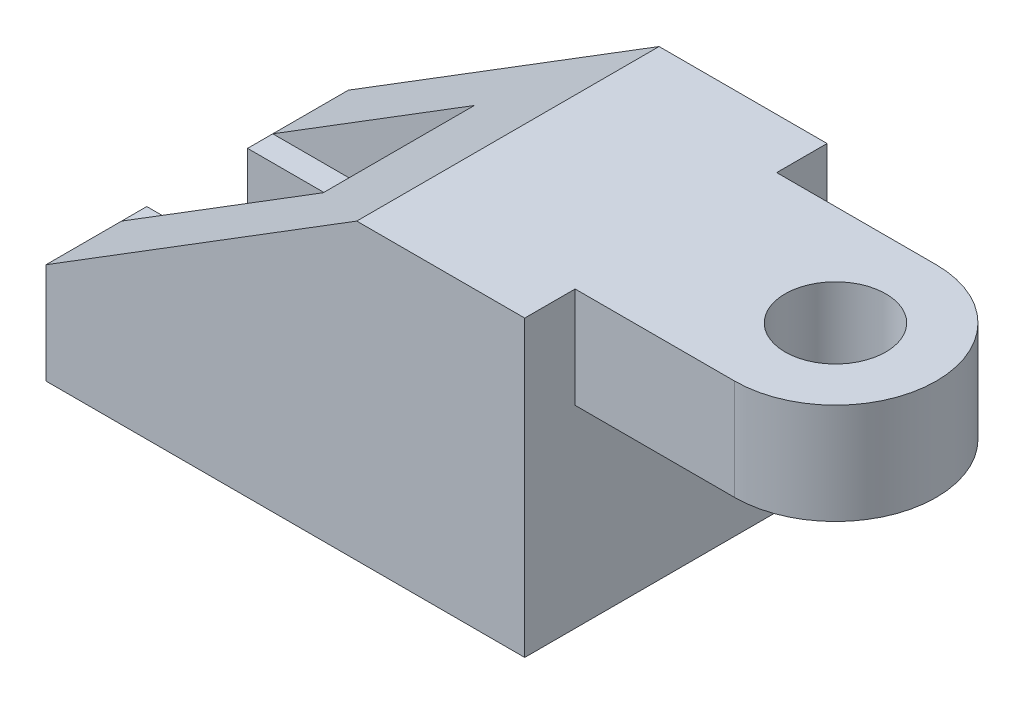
ISO-10303-21;
HEADER;
FILE_DESCRIPTION(('STEP AP214'),'2;1');
FILE_NAME('part.step','',(''),(''),'','','');
FILE_SCHEMA(('AUTOMOTIVE_DESIGN { 1 0 10303 214 1 1 1 1 }'));
ENDSEC;
DATA;
#1=APPLICATION_CONTEXT('core data for automotive mechanical design processes');
#2=APPLICATION_PROTOCOL_DEFINITION('international standard','automotive_design',2000,#1);
#3=PRODUCT_CONTEXT('',#1,'mechanical');
#4=PRODUCT('Part','Part','',(#3));
#5=PRODUCT_RELATED_PRODUCT_CATEGORY('part','',(#4));
#6=PRODUCT_DEFINITION_FORMATION('','',#4);
#7=PRODUCT_DEFINITION_CONTEXT('part definition',#1,'design');
#8=PRODUCT_DEFINITION('design','',#6,#7);
#9=PRODUCT_DEFINITION_SHAPE('','',#8);
#10=(LENGTH_UNIT() NAMED_UNIT(*) SI_UNIT(.MILLI.,.METRE.));
#11=(NAMED_UNIT(*) PLANE_ANGLE_UNIT() SI_UNIT($,.RADIAN.));
#12=(NAMED_UNIT(*) SI_UNIT($,.STERADIAN.) SOLID_ANGLE_UNIT());
#13=UNCERTAINTY_MEASURE_WITH_UNIT(LENGTH_MEASURE(1.E-05),#10,'distance_accuracy_value','');
#14=(GEOMETRIC_REPRESENTATION_CONTEXT(3) GLOBAL_UNCERTAINTY_ASSIGNED_CONTEXT((#13)) GLOBAL_UNIT_ASSIGNED_CONTEXT((#10,
#11,#12)) REPRESENTATION_CONTEXT('',''));
#15=CARTESIAN_POINT('',(0.,0.,0.));
#16=DIRECTION('',(0.,0.,1.));
#17=DIRECTION('',(1.,0.,0.));
#18=AXIS2_PLACEMENT_3D('',#15,#16,#17);
#19=CARTESIAN_POINT('',(0.,35.,18.));
#20=DIRECTION('',(-1.,0.,0.));
#21=DIRECTION('',(0.,-1.,0.));
#22=AXIS2_PLACEMENT_3D('',#19,#20,#21);
#23=PLANE('',#22);
#24=DIRECTION('',(0.,1.,0.));
#25=VECTOR('',#24,1.);
#26=CARTESIAN_POINT('',(0.,23.,-12.));
#27=LINE('',#26,#25);
#28=CARTESIAN_POINT('',(0.,23.,-12.));
#29=VERTEX_POINT('',#28);
#30=CARTESIAN_POINT('',(0.,35.,-12.));
#31=VERTEX_POINT('',#30);
#32=EDGE_CURVE('E165',#29,#31,#27,.T.);
#33=ORIENTED_EDGE('',*,*,#32,.F.);
#34=DIRECTION('',(0.,0.,1.));
#35=VECTOR('',#34,1.);
#36=CARTESIAN_POINT('',(0.,23.,12.));
#37=LINE('',#36,#35);
#38=CARTESIAN_POINT('',(0.,23.,12.));
#39=VERTEX_POINT('',#38);
#40=EDGE_CURVE('E158',#29,#39,#37,.T.);
#41=ORIENTED_EDGE('',*,*,#40,.T.);
#42=DIRECTION('',(0.,1.,0.));
#43=VECTOR('',#42,1.);
#44=CARTESIAN_POINT('',(0.,23.,12.));
#45=LINE('',#44,#43);
#46=CARTESIAN_POINT('',(0.,35.,12.));
#47=VERTEX_POINT('',#46);
#48=EDGE_CURVE('E144',#39,#47,#45,.T.);
#49=ORIENTED_EDGE('',*,*,#48,.T.);
#50=DIRECTION('',(0.,0.,-1.));
#51=VECTOR('',#50,1.);
#52=CARTESIAN_POINT('',(0.,35.,18.));
#53=LINE('',#52,#51);
#54=CARTESIAN_POINT('',(0.,35.,18.));
#55=VERTEX_POINT('',#54);
#56=EDGE_CURVE('E11',#55,#47,#53,.T.);
#57=ORIENTED_EDGE('',*,*,#56,.F.);
#58=DIRECTION('',(0.,1.,0.));
#59=VECTOR('',#58,1.);
#60=CARTESIAN_POINT('',(0.,35.,18.));
#61=LINE('',#60,#59);
#62=CARTESIAN_POINT('',(0.,0.,18.));
#63=VERTEX_POINT('',#62);
#64=EDGE_CURVE('E247',#63,#55,#61,.T.);
#65=ORIENTED_EDGE('',*,*,#64,.F.);
#66=DIRECTION('',(0.,0.,-1.));
#67=VECTOR('',#66,1.);
#68=CARTESIAN_POINT('',(0.,0.,18.));
#69=LINE('',#68,#67);
#70=CARTESIAN_POINT('',(0.,0.,-18.));
#71=VERTEX_POINT('',#70);
#72=EDGE_CURVE('E259',#63,#71,#69,.T.);
#73=ORIENTED_EDGE('',*,*,#72,.T.);
#74=DIRECTION('',(0.,1.,0.));
#75=VECTOR('',#74,1.);
#76=CARTESIAN_POINT('',(0.,35.,-18.));
#77=LINE('',#76,#75);
#78=CARTESIAN_POINT('',(0.,35.,-18.));
#79=VERTEX_POINT('',#78);
#80=EDGE_CURVE('E241',#71,#79,#77,.T.);
#81=ORIENTED_EDGE('',*,*,#80,.T.);
#82=EDGE_CURVE('E39',#31,#79,#53,.T.);
#83=ORIENTED_EDGE('',*,*,#82,.F.);
#84=EDGE_LOOP('',(#33,#41,#49,#57,#65,#73,#81,#83));
#85=FACE_BOUND('',#84,.T.);
#86=ADVANCED_FACE('F31',(#85),#23,.F.);
#87=CARTESIAN_POINT('',(-57.,0.,18.));
#88=DIRECTION('',(1.,0.,0.));
#89=DIRECTION('',(0.,0.,-1.));
#90=AXIS2_PLACEMENT_3D('',#87,#88,#89);
#91=PLANE('',#90);
#92=DIRECTION('',(0.,0.,-1.));
#93=VECTOR('',#92,1.);
#94=CARTESIAN_POINT('',(-57.,0.,18.));
#95=LINE('',#94,#93);
#96=CARTESIAN_POINT('',(-57.,0.,-5.99999999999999));
#97=VERTEX_POINT('',#96);
#98=CARTESIAN_POINT('',(-57.,0.,-18.));
#99=VERTEX_POINT('',#98);
#100=EDGE_CURVE('E273',#97,#99,#95,.T.);
#101=ORIENTED_EDGE('',*,*,#100,.F.);
#102=DIRECTION('',(0.,1.,0.));
#103=VECTOR('',#102,1.);
#104=CARTESIAN_POINT('',(-57.,-6.00000000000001,-5.99999999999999));
#105=LINE('',#104,#103);
#106=CARTESIAN_POINT('',(-57.,12.,-5.99999999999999));
#107=VERTEX_POINT('',#106);
#108=EDGE_CURVE('E203',#97,#107,#105,.T.);
#109=ORIENTED_EDGE('',*,*,#108,.T.);
#110=DIRECTION('',(0.,0.,1.));
#111=VECTOR('',#110,1.);
#112=CARTESIAN_POINT('',(-57.,12.,-9.));
#113=LINE('',#112,#111);
#114=CARTESIAN_POINT('',(-57.,12.,-9.));
#115=VERTEX_POINT('',#114);
#116=EDGE_CURVE('E244',#115,#107,#113,.T.);
#117=ORIENTED_EDGE('',*,*,#116,.F.);
#118=DIRECTION('',(0.,0.,-1.));
#119=VECTOR('',#118,1.);
#120=CARTESIAN_POINT('',(-57.,12.,18.));
#121=LINE('',#120,#119);
#122=CARTESIAN_POINT('',(-57.,12.,-18.));
#123=VERTEX_POINT('',#122);
#124=EDGE_CURVE('E277',#115,#123,#121,.T.);
#125=ORIENTED_EDGE('',*,*,#124,.T.);
#126=DIRECTION('',(0.,-1.,0.));
#127=VECTOR('',#126,1.);
#128=CARTESIAN_POINT('',(-57.,0.,-18.));
#129=LINE('',#128,#127);
#130=EDGE_CURVE('E267',#123,#99,#129,.T.);
#131=ORIENTED_EDGE('',*,*,#130,.T.);
#132=EDGE_LOOP('',(#101,#109,#117,#125,#131));
#133=FACE_BOUND('',#132,.T.);
#134=ADVANCED_FACE('F300',(#133),#91,.F.);
#135=CARTESIAN_POINT('',(-20.,35.,18.));
#136=DIRECTION('',(0.,-1.,0.));
#137=DIRECTION('',(0.,0.,-1.));
#138=AXIS2_PLACEMENT_3D('',#135,#136,#137);
#139=PLANE('',#138);
#140=DIRECTION('',(-1.,0.,0.));
#141=VECTOR('',#140,1.);
#142=CARTESIAN_POINT('',(-20.,35.,-18.));
#143=LINE('',#142,#141);
#144=CARTESIAN_POINT('',(-20.,35.,-18.));
#145=VERTEX_POINT('',#144);
#146=EDGE_CURVE('E262',#79,#145,#143,.T.);
#147=ORIENTED_EDGE('',*,*,#146,.T.);
#148=DIRECTION('',(0.,0.,-1.));
#149=VECTOR('',#148,1.);
#150=CARTESIAN_POINT('',(-20.,35.,18.));
#151=LINE('',#150,#149);
#152=CARTESIAN_POINT('',(-20.,35.,18.));
#153=VERTEX_POINT('',#152);
#154=EDGE_CURVE('E281',#153,#145,#151,.T.);
#155=ORIENTED_EDGE('',*,*,#154,.F.);
#156=DIRECTION('',(-1.,0.,0.));
#157=VECTOR('',#156,1.);
#158=CARTESIAN_POINT('',(-20.,35.,18.));
#159=LINE('',#158,#157);
#160=EDGE_CURVE('E250',#55,#153,#159,.T.);
#161=ORIENTED_EDGE('',*,*,#160,.F.);
#162=ORIENTED_EDGE('',*,*,#56,.T.);
#163=DIRECTION('',(1.,0.,0.));
#164=VECTOR('',#163,1.);
#165=CARTESIAN_POINT('',(19.,35.,12.));
#166=LINE('',#165,#164);
#167=CARTESIAN_POINT('',(19.,35.,12.));
#168=VERTEX_POINT('',#167);
#169=EDGE_CURVE('E47',#47,#168,#166,.T.);
#170=ORIENTED_EDGE('',*,*,#169,.T.);
#171=CARTESIAN_POINT('',(19.,35.,0.));
#172=DIRECTION('',(0.,1.,0.));
#173=DIRECTION('',(0.,0.,-1.));
#174=AXIS2_PLACEMENT_3D('',#171,#172,#173);
#175=CIRCLE('',#174,12.);
#176=CARTESIAN_POINT('',(19.,35.,-12.));
#177=VERTEX_POINT('',#176);
#178=EDGE_CURVE('E169',#168,#177,#175,.T.);
#179=ORIENTED_EDGE('',*,*,#178,.T.);
#180=DIRECTION('',(-1.,0.,0.));
#181=VECTOR('',#180,1.);
#182=CARTESIAN_POINT('',(0.,35.,-12.));
#183=LINE('',#182,#181);
#184=EDGE_CURVE('E166',#177,#31,#183,.T.);
#185=ORIENTED_EDGE('',*,*,#184,.T.);
#186=ORIENTED_EDGE('',*,*,#82,.T.);
#187=EDGE_LOOP('',(#147,#155,#161,#162,#170,#179,#185,#186));
#188=FACE_BOUND('',#187,.T.);
#189=CARTESIAN_POINT('',(19.,35.,0.));
#190=DIRECTION('',(0.,1.,0.));
#191=DIRECTION('',(0.,0.,1.));
#192=AXIS2_PLACEMENT_3D('',#189,#190,#191);
#193=CIRCLE('',#192,6.);
#194=CARTESIAN_POINT('',(19.,35.,6.));
#195=VERTEX_POINT('',#194);
#196=EDGE_CURVE('E171',#195,#195,#193,.T.);
#197=ORIENTED_EDGE('',*,*,#196,.F.);
#198=EDGE_LOOP('',(#197));
#199=FACE_BOUND('',#198,.T.);
#200=ADVANCED_FACE('F297',(#188,#199),#139,.F.);
#201=CARTESIAN_POINT('',(-57.,12.,18.));
#202=DIRECTION('',(0.527934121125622,-0.849285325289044,0.));
#203=DIRECTION('',(0.849285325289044,0.527934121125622,0.));
#204=AXIS2_PLACEMENT_3D('',#201,#202,#203);
#205=PLANE('',#204);
#206=ORIENTED_EDGE('',*,*,#124,.F.);
#207=DIRECTION('',(-0.849285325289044,-0.527934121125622,0.));
#208=VECTOR('',#207,1.);
#209=CARTESIAN_POINT('',(-33.,26.9189189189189,-9.));
#210=LINE('',#209,#208);
#211=CARTESIAN_POINT('',(-33.,26.9189189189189,-9.));
#212=VERTEX_POINT('',#211);
#213=EDGE_CURVE('E221',#212,#115,#210,.T.);
#214=ORIENTED_EDGE('',*,*,#213,.F.);
#215=DIRECTION('',(0.,0.,1.));
#216=VECTOR('',#215,1.);
#217=CARTESIAN_POINT('',(-33.,26.9189189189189,-9.));
#218=LINE('',#217,#216);
#219=CARTESIAN_POINT('',(-33.,26.9189189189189,9.));
#220=VERTEX_POINT('',#219);
#221=EDGE_CURVE('E238',#212,#220,#218,.T.);
#222=ORIENTED_EDGE('',*,*,#221,.T.);
#223=DIRECTION('',(-0.849285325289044,-0.527934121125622,0.));
#224=VECTOR('',#223,1.);
#225=CARTESIAN_POINT('',(-33.,26.9189189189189,9.));
#226=LINE('',#225,#224);
#227=CARTESIAN_POINT('',(-57.,12.,9.));
#228=VERTEX_POINT('',#227);
#229=EDGE_CURVE('E220',#220,#228,#226,.T.);
#230=ORIENTED_EDGE('',*,*,#229,.T.);
#231=CARTESIAN_POINT('',(-57.,12.,18.));
#232=VERTEX_POINT('',#231);
#233=EDGE_CURVE('E278',#232,#228,#121,.T.);
#234=ORIENTED_EDGE('',*,*,#233,.F.);
#235=DIRECTION('',(-0.849285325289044,-0.527934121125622,0.));
#236=VECTOR('',#235,1.);
#237=CARTESIAN_POINT('',(-57.,12.,18.));
#238=LINE('',#237,#236);
#239=EDGE_CURVE('E253',#153,#232,#238,.T.);
#240=ORIENTED_EDGE('',*,*,#239,.F.);
#241=ORIENTED_EDGE('',*,*,#154,.T.);
#242=DIRECTION('',(-0.849285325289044,-0.527934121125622,0.));
#243=VECTOR('',#242,1.);
#244=CARTESIAN_POINT('',(-57.,12.,-18.));
#245=LINE('',#244,#243);
#246=EDGE_CURVE('E264',#145,#123,#245,.T.);
#247=ORIENTED_EDGE('',*,*,#246,.T.);
#248=EDGE_LOOP('',(#206,#214,#222,#230,#234,#240,#241,#247));
#249=FACE_BOUND('',#248,.T.);
#250=ADVANCED_FACE('F299',(#249),#205,.F.);
#251=CARTESIAN_POINT('',(-57.,12.,6.00000000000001));
#252=VERTEX_POINT('',#251);
#253=EDGE_CURVE('E230',#252,#228,#113,.T.);
#254=ORIENTED_EDGE('',*,*,#253,.F.);
#255=DIRECTION('',(0.,1.,0.));
#256=VECTOR('',#255,1.);
#257=CARTESIAN_POINT('',(-57.,-6.00000000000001,6.00000000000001));
#258=LINE('',#257,#256);
#259=CARTESIAN_POINT('',(-57.,0.,6.00000000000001));
#260=VERTEX_POINT('',#259);
#261=EDGE_CURVE('E55',#260,#252,#258,.T.);
#262=ORIENTED_EDGE('',*,*,#261,.F.);
#263=CARTESIAN_POINT('',(-57.,0.,18.));
#264=VERTEX_POINT('',#263);
#265=EDGE_CURVE('E274',#264,#260,#95,.T.);
#266=ORIENTED_EDGE('',*,*,#265,.F.);
#267=DIRECTION('',(0.,-1.,0.));
#268=VECTOR('',#267,1.);
#269=CARTESIAN_POINT('',(-57.,0.,18.));
#270=LINE('',#269,#268);
#271=EDGE_CURVE('E255',#232,#264,#270,.T.);
#272=ORIENTED_EDGE('',*,*,#271,.F.);
#273=ORIENTED_EDGE('',*,*,#233,.T.);
#274=EDGE_LOOP('',(#254,#262,#266,#272,#273));
#275=FACE_BOUND('',#274,.T.);
#276=ADVANCED_FACE('F305',(#275),#91,.F.);
#277=CARTESIAN_POINT('',(0.,0.,18.));
#278=DIRECTION('',(0.,1.,0.));
#279=DIRECTION('',(-1.,0.,0.));
#280=AXIS2_PLACEMENT_3D('',#277,#278,#279);
#281=PLANE('',#280);
#282=CARTESIAN_POINT('',(-44.,0.,0.));
#283=DIRECTION('',(0.,1.,0.));
#284=DIRECTION('',(-1.,0.,0.));
#285=AXIS2_PLACEMENT_3D('',#282,#283,#284);
#286=CIRCLE('',#285,6.);
#287=CARTESIAN_POINT('',(-44.,0.,6.));
#288=VERTEX_POINT('',#287);
#289=CARTESIAN_POINT('',(-44.,0.,-5.99999999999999));
#290=VERTEX_POINT('',#289);
#291=EDGE_CURVE('E214',#288,#290,#286,.T.);
#292=ORIENTED_EDGE('',*,*,#291,.T.);
#293=DIRECTION('',(-1.,0.,0.));
#294=VECTOR('',#293,1.);
#295=CARTESIAN_POINT('',(0.,0.,-5.99999999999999));
#296=LINE('',#295,#294);
#297=EDGE_CURVE('E217',#290,#97,#296,.T.);
#298=ORIENTED_EDGE('',*,*,#297,.T.);
#299=ORIENTED_EDGE('',*,*,#100,.T.);
#300=DIRECTION('',(1.,0.,0.));
#301=VECTOR('',#300,1.);
#302=CARTESIAN_POINT('',(0.,0.,-18.));
#303=LINE('',#302,#301);
#304=EDGE_CURVE('E251',#99,#71,#303,.T.);
#305=ORIENTED_EDGE('',*,*,#304,.T.);
#306=ORIENTED_EDGE('',*,*,#72,.F.);
#307=DIRECTION('',(1.,0.,0.));
#308=VECTOR('',#307,1.);
#309=CARTESIAN_POINT('',(0.,0.,18.));
#310=LINE('',#309,#308);
#311=EDGE_CURVE('E257',#264,#63,#310,.T.);
#312=ORIENTED_EDGE('',*,*,#311,.F.);
#313=ORIENTED_EDGE('',*,*,#265,.T.);
#314=DIRECTION('',(1.,0.,0.));
#315=VECTOR('',#314,1.);
#316=CARTESIAN_POINT('',(0.,0.,5.99999999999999));
#317=LINE('',#316,#315);
#318=EDGE_CURVE('E206',#260,#288,#317,.T.);
#319=ORIENTED_EDGE('',*,*,#318,.T.);
#320=EDGE_LOOP('',(#292,#298,#299,#305,#306,#312,#313,#319));
#321=FACE_BOUND('',#320,.T.);
#322=ADVANCED_FACE('F334',(#321),#281,.F.);
#323=CARTESIAN_POINT('',(0.,35.,18.));
#324=DIRECTION('',(0.,0.,1.));
#325=DIRECTION('',(1.,0.,0.));
#326=AXIS2_PLACEMENT_3D('',#323,#324,#325);
#327=PLANE('',#326);
#328=ORIENTED_EDGE('',*,*,#64,.T.);
#329=ORIENTED_EDGE('',*,*,#160,.T.);
#330=ORIENTED_EDGE('',*,*,#239,.T.);
#331=ORIENTED_EDGE('',*,*,#271,.T.);
#332=ORIENTED_EDGE('',*,*,#311,.T.);
#333=EDGE_LOOP('',(#328,#329,#330,#331,#332));
#334=FACE_BOUND('',#333,.T.);
#335=ADVANCED_FACE('F344',(#334),#327,.T.);
#336=CARTESIAN_POINT('',(0.,35.,-18.));
#337=DIRECTION('',(0.,0.,1.));
#338=DIRECTION('',(1.,0.,0.));
#339=AXIS2_PLACEMENT_3D('',#336,#337,#338);
#340=PLANE('',#339);
#341=ORIENTED_EDGE('',*,*,#80,.F.);
#342=ORIENTED_EDGE('',*,*,#304,.F.);
#343=ORIENTED_EDGE('',*,*,#130,.F.);
#344=ORIENTED_EDGE('',*,*,#246,.F.);
#345=ORIENTED_EDGE('',*,*,#146,.F.);
#346=EDGE_LOOP('',(#341,#342,#343,#344,#345));
#347=FACE_BOUND('',#346,.T.);
#348=ADVANCED_FACE('F453',(#347),#340,.F.);
#349=CARTESIAN_POINT('',(-33.,12.,-9.));
#350=DIRECTION('',(1.,0.,0.));
#351=DIRECTION('',(0.,0.,-1.));
#352=AXIS2_PLACEMENT_3D('',#349,#350,#351);
#353=PLANE('',#352);
#354=DIRECTION('',(0.,1.,0.));
#355=VECTOR('',#354,1.);
#356=CARTESIAN_POINT('',(-33.,12.,9.));
#357=LINE('',#356,#355);
#358=CARTESIAN_POINT('',(-33.,12.,9.));
#359=VERTEX_POINT('',#358);
#360=EDGE_CURVE('E224',#359,#220,#357,.T.);
#361=ORIENTED_EDGE('',*,*,#360,.T.);
#362=ORIENTED_EDGE('',*,*,#221,.F.);
#363=DIRECTION('',(0.,1.,0.));
#364=VECTOR('',#363,1.);
#365=CARTESIAN_POINT('',(-33.,12.,-9.));
#366=LINE('',#365,#364);
#367=CARTESIAN_POINT('',(-33.,12.,-9.));
#368=VERTEX_POINT('',#367);
#369=EDGE_CURVE('E227',#368,#212,#366,.T.);
#370=ORIENTED_EDGE('',*,*,#369,.F.);
#371=DIRECTION('',(0.,0.,1.));
#372=VECTOR('',#371,1.);
#373=CARTESIAN_POINT('',(-33.,12.,-9.));
#374=LINE('',#373,#372);
#375=EDGE_CURVE('E242',#368,#359,#374,.T.);
#376=ORIENTED_EDGE('',*,*,#375,.T.);
#377=EDGE_LOOP('',(#361,#362,#370,#376));
#378=FACE_BOUND('',#377,.T.);
#379=ADVANCED_FACE('F358',(#378),#353,.F.);
#380=CARTESIAN_POINT('',(-57.,12.,-9.));
#381=DIRECTION('',(0.,-1.,0.));
#382=DIRECTION('',(0.,0.,-1.));
#383=AXIS2_PLACEMENT_3D('',#380,#381,#382);
#384=PLANE('',#383);
#385=ORIENTED_EDGE('',*,*,#116,.T.);
#386=DIRECTION('',(-1.,0.,0.));
#387=VECTOR('',#386,1.);
#388=CARTESIAN_POINT('',(-57.,12.,-5.99999999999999));
#389=LINE('',#388,#387);
#390=CARTESIAN_POINT('',(-44.,12.,-5.99999999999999));
#391=VERTEX_POINT('',#390);
#392=EDGE_CURVE('E197',#391,#107,#389,.T.);
#393=ORIENTED_EDGE('',*,*,#392,.F.);
#394=CARTESIAN_POINT('',(-44.,12.,0.));
#395=DIRECTION('',(0.,1.,0.));
#396=DIRECTION('',(0.,0.,-1.));
#397=AXIS2_PLACEMENT_3D('',#394,#395,#396);
#398=CIRCLE('',#397,6.);
#399=CARTESIAN_POINT('',(-44.,12.,6.));
#400=VERTEX_POINT('',#399);
#401=EDGE_CURVE('E193',#400,#391,#398,.T.);
#402=ORIENTED_EDGE('',*,*,#401,.F.);
#403=DIRECTION('',(1.,0.,0.));
#404=VECTOR('',#403,1.);
#405=CARTESIAN_POINT('',(-44.,12.,6.));
#406=LINE('',#405,#404);
#407=EDGE_CURVE('E183',#252,#400,#406,.T.);
#408=ORIENTED_EDGE('',*,*,#407,.F.);
#409=ORIENTED_EDGE('',*,*,#253,.T.);
#410=DIRECTION('',(1.,0.,0.));
#411=VECTOR('',#410,1.);
#412=CARTESIAN_POINT('',(-57.,12.,9.));
#413=LINE('',#412,#411);
#414=EDGE_CURVE('E233',#228,#359,#413,.T.);
#415=ORIENTED_EDGE('',*,*,#414,.T.);
#416=ORIENTED_EDGE('',*,*,#375,.F.);
#417=DIRECTION('',(1.,0.,0.));
#418=VECTOR('',#417,1.);
#419=CARTESIAN_POINT('',(-57.,12.,-9.));
#420=LINE('',#419,#418);
#421=EDGE_CURVE('E223',#115,#368,#420,.T.);
#422=ORIENTED_EDGE('',*,*,#421,.F.);
#423=EDGE_LOOP('',(#385,#393,#402,#408,#409,#415,#416,#422));
#424=FACE_BOUND('',#423,.T.);
#425=ADVANCED_FACE('F352',(#424),#384,.F.);
#426=CARTESIAN_POINT('',(-33.,26.9189189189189,-9.));
#427=DIRECTION('',(0.,0.,-1.));
#428=DIRECTION('',(-1.,0.,0.));
#429=AXIS2_PLACEMENT_3D('',#426,#427,#428);
#430=PLANE('',#429);
#431=ORIENTED_EDGE('',*,*,#213,.T.);
#432=ORIENTED_EDGE('',*,*,#421,.T.);
#433=ORIENTED_EDGE('',*,*,#369,.T.);
#434=EDGE_LOOP('',(#431,#432,#433));
#435=FACE_BOUND('',#434,.T.);
#436=ADVANCED_FACE('F357',(#435),#430,.F.);
#437=CARTESIAN_POINT('',(-33.,26.9189189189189,9.));
#438=DIRECTION('',(0.,0.,-1.));
#439=DIRECTION('',(-1.,0.,0.));
#440=AXIS2_PLACEMENT_3D('',#437,#438,#439);
#441=PLANE('',#440);
#442=ORIENTED_EDGE('',*,*,#229,.F.);
#443=ORIENTED_EDGE('',*,*,#360,.F.);
#444=ORIENTED_EDGE('',*,*,#414,.F.);
#445=EDGE_LOOP('',(#442,#443,#444));
#446=FACE_BOUND('',#445,.T.);
#447=ADVANCED_FACE('F326',(#446),#441,.T.);
#448=CARTESIAN_POINT('',(-57.,-6.00000000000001,-5.99999999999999));
#449=DIRECTION('',(0.,0.,-1.));
#450=DIRECTION('',(-1.,0.,0.));
#451=AXIS2_PLACEMENT_3D('',#448,#449,#450);
#452=PLANE('',#451);
#453=DIRECTION('',(0.,1.,0.));
#454=VECTOR('',#453,1.);
#455=CARTESIAN_POINT('',(-44.,-6.00000000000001,-5.99999999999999));
#456=LINE('',#455,#454);
#457=EDGE_CURVE('E207',#290,#391,#456,.T.);
#458=ORIENTED_EDGE('',*,*,#457,.T.);
#459=ORIENTED_EDGE('',*,*,#392,.T.);
#460=ORIENTED_EDGE('',*,*,#108,.F.);
#461=ORIENTED_EDGE('',*,*,#297,.F.);
#462=EDGE_LOOP('',(#458,#459,#460,#461));
#463=FACE_BOUND('',#462,.T.);
#464=ADVANCED_FACE('F368',(#463),#452,.F.);
#465=CARTESIAN_POINT('',(-44.,-6.00000000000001,0.));
#466=DIRECTION('',(0.,1.,0.));
#467=DIRECTION('',(0.,0.,1.));
#468=AXIS2_PLACEMENT_3D('',#465,#466,#467);
#469=CYLINDRICAL_SURFACE('',#468,6.);
#470=DIRECTION('',(0.,1.,0.));
#471=VECTOR('',#470,1.);
#472=CARTESIAN_POINT('',(-44.,-6.00000000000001,6.));
#473=LINE('',#472,#471);
#474=EDGE_CURVE('E209',#288,#400,#473,.T.);
#475=ORIENTED_EDGE('',*,*,#474,.T.);
#476=ORIENTED_EDGE('',*,*,#401,.T.);
#477=ORIENTED_EDGE('',*,*,#457,.F.);
#478=ORIENTED_EDGE('',*,*,#291,.F.);
#479=EDGE_LOOP('',(#475,#476,#477,#478));
#480=FACE_BOUND('',#479,.T.);
#481=ADVANCED_FACE('F372',(#480),#469,.F.);
#482=CARTESIAN_POINT('',(-44.,-6.00000000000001,6.));
#483=DIRECTION('',(0.,0.,1.));
#484=DIRECTION('',(1.,0.,0.));
#485=AXIS2_PLACEMENT_3D('',#482,#483,#484);
#486=PLANE('',#485);
#487=ORIENTED_EDGE('',*,*,#261,.T.);
#488=ORIENTED_EDGE('',*,*,#407,.T.);
#489=ORIENTED_EDGE('',*,*,#474,.F.);
#490=ORIENTED_EDGE('',*,*,#318,.F.);
#491=EDGE_LOOP('',(#487,#488,#489,#490));
#492=FACE_BOUND('',#491,.T.);
#493=ADVANCED_FACE('F381',(#492),#486,.F.);
#494=CARTESIAN_POINT('',(0.,23.,-12.));
#495=DIRECTION('',(0.,0.,-1.));
#496=DIRECTION('',(-1.,0.,0.));
#497=AXIS2_PLACEMENT_3D('',#494,#495,#496);
#498=PLANE('',#497);
#499=ORIENTED_EDGE('',*,*,#184,.F.);
#500=DIRECTION('',(0.,1.,0.));
#501=VECTOR('',#500,1.);
#502=CARTESIAN_POINT('',(19.,23.,-12.));
#503=LINE('',#502,#501);
#504=CARTESIAN_POINT('',(19.,23.,-12.));
#505=VERTEX_POINT('',#504);
#506=EDGE_CURVE('E178',#505,#177,#503,.T.);
#507=ORIENTED_EDGE('',*,*,#506,.F.);
#508=DIRECTION('',(-1.,0.,0.));
#509=VECTOR('',#508,1.);
#510=CARTESIAN_POINT('',(0.,23.,-12.));
#511=LINE('',#510,#509);
#512=EDGE_CURVE('E152',#505,#29,#511,.T.);
#513=ORIENTED_EDGE('',*,*,#512,.T.);
#514=ORIENTED_EDGE('',*,*,#32,.T.);
#515=EDGE_LOOP('',(#499,#507,#513,#514));
#516=FACE_BOUND('',#515,.T.);
#517=ADVANCED_FACE('F389',(#516),#498,.T.);
#518=CARTESIAN_POINT('',(19.,23.,0.));
#519=DIRECTION('',(0.,1.,0.));
#520=DIRECTION('',(0.,0.,1.));
#521=AXIS2_PLACEMENT_3D('',#518,#519,#520);
#522=CYLINDRICAL_SURFACE('',#521,12.);
#523=ORIENTED_EDGE('',*,*,#178,.F.);
#524=DIRECTION('',(0.,1.,0.));
#525=VECTOR('',#524,1.);
#526=CARTESIAN_POINT('',(19.,23.,12.));
#527=LINE('',#526,#525);
#528=CARTESIAN_POINT('',(19.,23.,12.));
#529=VERTEX_POINT('',#528);
#530=EDGE_CURVE('E151',#529,#168,#527,.T.);
#531=ORIENTED_EDGE('',*,*,#530,.F.);
#532=CARTESIAN_POINT('',(19.,23.,0.));
#533=DIRECTION('',(0.,1.,0.));
#534=DIRECTION('',(0.,0.,-1.));
#535=AXIS2_PLACEMENT_3D('',#532,#533,#534);
#536=CIRCLE('',#535,12.);
#537=EDGE_CURVE('E161',#529,#505,#536,.T.);
#538=ORIENTED_EDGE('',*,*,#537,.T.);
#539=ORIENTED_EDGE('',*,*,#506,.T.);
#540=EDGE_LOOP('',(#523,#531,#538,#539));
#541=FACE_BOUND('',#540,.T.);
#542=ADVANCED_FACE('F398',(#541),#522,.T.);
#543=CARTESIAN_POINT('',(19.,23.,12.));
#544=DIRECTION('',(0.,0.,1.));
#545=DIRECTION('',(1.,0.,0.));
#546=AXIS2_PLACEMENT_3D('',#543,#544,#545);
#547=PLANE('',#546);
#548=ORIENTED_EDGE('',*,*,#169,.F.);
#549=ORIENTED_EDGE('',*,*,#48,.F.);
#550=DIRECTION('',(1.,0.,0.));
#551=VECTOR('',#550,1.);
#552=CARTESIAN_POINT('',(19.,23.,12.));
#553=LINE('',#552,#551);
#554=EDGE_CURVE('E147',#39,#529,#553,.T.);
#555=ORIENTED_EDGE('',*,*,#554,.T.);
#556=ORIENTED_EDGE('',*,*,#530,.T.);
#557=EDGE_LOOP('',(#548,#549,#555,#556));
#558=FACE_BOUND('',#557,.T.);
#559=ADVANCED_FACE('F146',(#558),#547,.T.);
#560=CARTESIAN_POINT('',(19.,23.,0.));
#561=DIRECTION('',(0.,-1.,0.));
#562=DIRECTION('',(0.,0.,-1.));
#563=AXIS2_PLACEMENT_3D('',#560,#561,#562);
#564=PLANE('',#563);
#565=CARTESIAN_POINT('',(19.,23.,0.));
#566=DIRECTION('',(0.,1.,0.));
#567=DIRECTION('',(0.,0.,1.));
#568=AXIS2_PLACEMENT_3D('',#565,#566,#567);
#569=CIRCLE('',#568,6.);
#570=CARTESIAN_POINT('',(19.,23.,6.));
#571=VERTEX_POINT('',#570);
#572=EDGE_CURVE('E287',#571,#571,#569,.T.);
#573=ORIENTED_EDGE('',*,*,#572,.T.);
#574=EDGE_LOOP('',(#573));
#575=FACE_BOUND('',#574,.T.);
#576=ORIENTED_EDGE('',*,*,#40,.F.);
#577=ORIENTED_EDGE('',*,*,#512,.F.);
#578=ORIENTED_EDGE('',*,*,#537,.F.);
#579=ORIENTED_EDGE('',*,*,#554,.F.);
#580=EDGE_LOOP('',(#576,#577,#578,#579));
#581=FACE_BOUND('',#580,.T.);
#582=ADVANCED_FACE('F156',(#575,#581),#564,.T.);
#583=CARTESIAN_POINT('',(19.,23.,0.));
#584=DIRECTION('',(0.,1.,0.));
#585=DIRECTION('',(0.,0.,1.));
#586=AXIS2_PLACEMENT_3D('',#583,#584,#585);
#587=CYLINDRICAL_SURFACE('',#586,6.);
#588=ORIENTED_EDGE('',*,*,#572,.F.);
#589=EDGE_LOOP('',(#588));
#590=FACE_BOUND('',#589,.T.);
#591=ORIENTED_EDGE('',*,*,#196,.T.);
#592=EDGE_LOOP('',(#591));
#593=FACE_BOUND('',#592,.T.);
#594=ADVANCED_FACE('F295',(#590,#593),#587,.F.);
#595=CLOSED_SHELL('',(#86,#134,#200,#250,#276,#322,#335,#348,#379,#425,#436,#447,#464,#481,#493,
#517,#542,#559,#582,#594));
#596=MANIFOLD_SOLID_BREP('B2',#595);
#597=ADVANCED_BREP_SHAPE_REPRESENTATION('',(#18,#596),#14);
#598=SHAPE_DEFINITION_REPRESENTATION(#9,#597);
ENDSEC;
END-ISO-10303-21;
